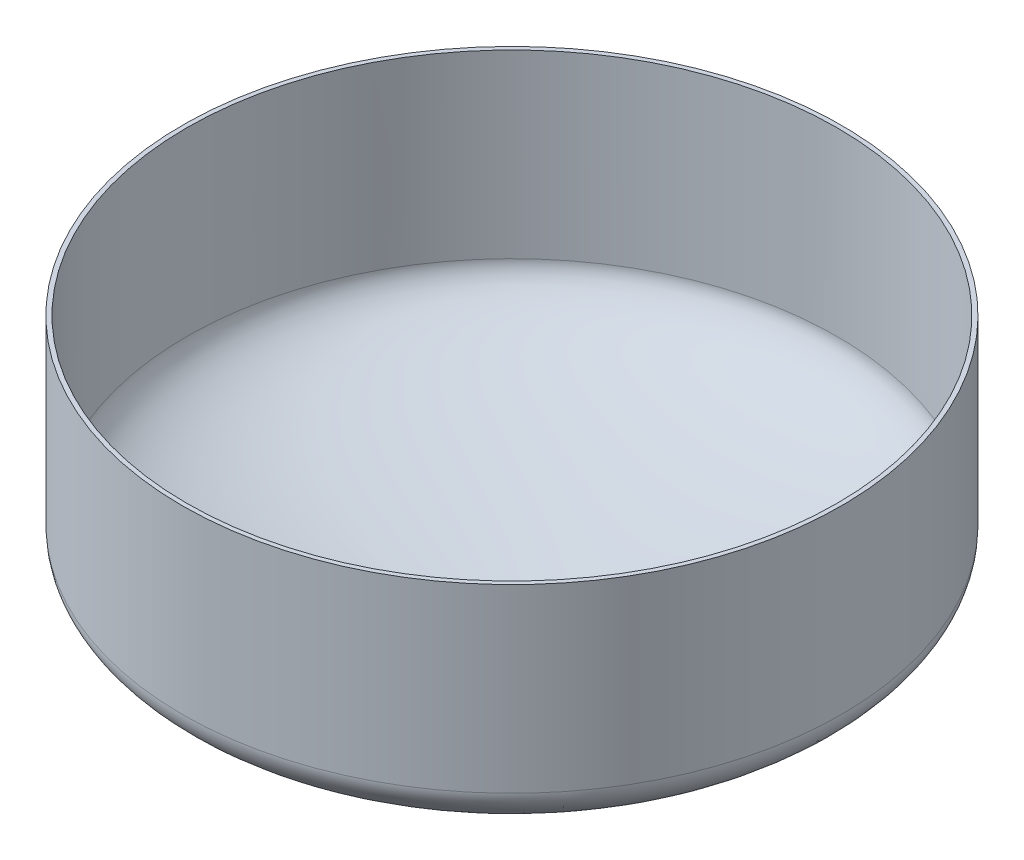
ISO-10303-21;
HEADER;
FILE_DESCRIPTION(('STEP AP214'),'2;1');
FILE_NAME('part.step','',(''),(''),'','','');
FILE_SCHEMA(('AUTOMOTIVE_DESIGN { 1 0 10303 214 1 1 1 1 }'));
ENDSEC;
DATA;
#1=APPLICATION_CONTEXT('core data for automotive mechanical design processes');
#2=APPLICATION_PROTOCOL_DEFINITION('international standard','automotive_design',2000,#1);
#3=PRODUCT_CONTEXT('',#1,'mechanical');
#4=PRODUCT('Part','Part','',(#3));
#5=PRODUCT_RELATED_PRODUCT_CATEGORY('part','',(#4));
#6=PRODUCT_DEFINITION_FORMATION('','',#4);
#7=PRODUCT_DEFINITION_CONTEXT('part definition',#1,'design');
#8=PRODUCT_DEFINITION('design','',#6,#7);
#9=PRODUCT_DEFINITION_SHAPE('','',#8);
#10=(LENGTH_UNIT() NAMED_UNIT(*) SI_UNIT(.MILLI.,.METRE.));
#11=(NAMED_UNIT(*) PLANE_ANGLE_UNIT() SI_UNIT($,.RADIAN.));
#12=(NAMED_UNIT(*) SI_UNIT($,.STERADIAN.) SOLID_ANGLE_UNIT());
#13=UNCERTAINTY_MEASURE_WITH_UNIT(LENGTH_MEASURE(1.E-05),#10,'distance_accuracy_value','');
#14=(GEOMETRIC_REPRESENTATION_CONTEXT(3) GLOBAL_UNCERTAINTY_ASSIGNED_CONTEXT((#13)) GLOBAL_UNIT_ASSIGNED_CONTEXT((#10,
#11,#12)) REPRESENTATION_CONTEXT('',''));
#15=CARTESIAN_POINT('',(0.,0.,0.));
#16=DIRECTION('',(0.,0.,1.));
#17=DIRECTION('',(1.,0.,0.));
#18=AXIS2_PLACEMENT_3D('',#15,#16,#17);
#19=CARTESIAN_POINT('',(0.,165.,-190.));
#20=DIRECTION('',(0.,-1.,0.));
#21=DIRECTION('',(0.,0.,-1.));
#22=AXIS2_PLACEMENT_3D('',#19,#20,#21);
#23=PLANE('',#22);
#24=CARTESIAN_POINT('',(0.,165.,0.));
#25=DIRECTION('',(0.,1.,0.));
#26=DIRECTION('',(0.,0.,1.));
#27=AXIS2_PLACEMENT_3D('',#24,#25,#26);
#28=CIRCLE('',#27,190.);
#29=CARTESIAN_POINT('',(0.,165.,190.));
#30=VERTEX_POINT('',#29);
#31=EDGE_CURVE('E50',#30,#30,#28,.T.);
#32=ORIENTED_EDGE('',*,*,#31,.T.);
#33=EDGE_LOOP('',(#32));
#34=FACE_BOUND('',#33,.T.);
#35=CARTESIAN_POINT('',(0.,165.,0.));
#36=DIRECTION('',(0.,-1.,0.));
#37=DIRECTION('',(0.,0.,-1.));
#38=AXIS2_PLACEMENT_3D('',#35,#36,#37);
#39=CIRCLE('',#38,187.5);
#40=CARTESIAN_POINT('',(0.,165.,-187.5));
#41=VERTEX_POINT('',#40);
#42=EDGE_CURVE('E55',#41,#41,#39,.F.);
#43=ORIENTED_EDGE('',*,*,#42,.F.);
#44=EDGE_LOOP('',(#43));
#45=FACE_BOUND('',#44,.T.);
#46=ADVANCED_FACE('F33',(#34,#45),#23,.F.);
#47=CARTESIAN_POINT('',(0.,0.,0.));
#48=DIRECTION('',(0.,1.,0.));
#49=DIRECTION('',(0.,0.,1.));
#50=AXIS2_PLACEMENT_3D('',#47,#48,#49);
#51=PLANE('',#50);
#52=CARTESIAN_POINT('',(0.,0.,0.));
#53=DIRECTION('',(0.,-1.,0.));
#54=DIRECTION('',(0.,0.,-1.));
#55=AXIS2_PLACEMENT_3D('',#52,#53,#54);
#56=CIRCLE('',#55,9.25);
#57=CARTESIAN_POINT('',(0.,0.,-9.25));
#58=VERTEX_POINT('',#57);
#59=EDGE_CURVE('E56',#58,#58,#56,.T.);
#60=ORIENTED_EDGE('',*,*,#59,.F.);
#61=EDGE_LOOP('',(#60));
#62=FACE_BOUND('',#61,.T.);
#63=CARTESIAN_POINT('',(0.,0.,0.));
#64=DIRECTION('',(0.,1.,0.));
#65=DIRECTION('',(0.,0.,1.));
#66=AXIS2_PLACEMENT_3D('',#63,#64,#65);
#67=CIRCLE('',#66,29.9999999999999);
#68=CARTESIAN_POINT('',(0.,0.,29.9999999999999));
#69=VERTEX_POINT('',#68);
#70=EDGE_CURVE('E10',#69,#69,#67,.T.);
#71=ORIENTED_EDGE('',*,*,#70,.F.);
#72=EDGE_LOOP('',(#71));
#73=FACE_BOUND('',#72,.T.);
#74=ADVANCED_FACE('F35',(#62,#73),#51,.F.);
#75=CARTESIAN_POINT('',(0.,60.7998342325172,187.780368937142));
#76=DIRECTION('',(1.,0.,0.));
#77=DIRECTION('',(0.,0.,-1.));
#78=AXIS2_PLACEMENT_3D('',#75,#76,#77);
#79=ELLIPSE('',#78,377.780368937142,74.407850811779);
#80=TRIMMED_CURVE('',#79,(PARAMETER_VALUE(5.23259887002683)),
(PARAMETER_VALUE(7.33377174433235)),.T.,.PARAMETER.);
#81=CARTESIAN_POINT('',(0.,182.531914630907,0.));
#82=DIRECTION('',(0.,1.,0.));
#83=AXIS1_PLACEMENT('',#81,#82);
#84=SURFACE_OF_REVOLUTION('',#80,#83);
#85=CARTESIAN_POINT('',(112.430937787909,15.6313178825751,0.));
#86=CARTESIAN_POINT('',(112.430940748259,15.6313185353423,-0.421427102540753));
#87=CARTESIAN_POINT('',(112.413594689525,15.627457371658,-0.842804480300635));
#88=CARTESIAN_POINT('',(112.344331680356,15.6120392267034,-1.68270476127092));
#89=CARTESIAN_POINT('',(112.292405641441,15.6004802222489,-2.1012268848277));
#90=CARTESIAN_POINT('',(112.154264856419,15.569727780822,-2.93274574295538));
#91=CARTESIAN_POINT('',(112.068013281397,15.5505261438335,-3.34573604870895));
#92=CARTESIAN_POINT('',(111.861837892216,15.5046230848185,-4.1627987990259));
#93=CARTESIAN_POINT('',(111.741914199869,15.477921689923,-4.56687127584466));
#94=CARTESIAN_POINT('',(111.469314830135,15.4172200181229,-5.36302845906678));
#95=CARTESIAN_POINT('',(111.316655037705,15.3832232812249,-5.75511887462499));
#96=CARTESIAN_POINT('',(110.979633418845,15.3081590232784,-6.52473497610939));
#97=CARTESIAN_POINT('',(110.795271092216,15.2670913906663,-6.90226043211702));
#98=CARTESIAN_POINT('',(110.396209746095,15.1781816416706,-7.63996116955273));
#99=CARTESIAN_POINT('',(110.181518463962,15.1303412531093,-8.0001408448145));
#100=CARTESIAN_POINT('',(109.723292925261,15.0282085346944,-8.70069162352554));
#101=CARTESIAN_POINT('',(109.479758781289,14.9739162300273,-9.0410628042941));
#102=CARTESIAN_POINT('',(108.965551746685,14.8592464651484,-9.69961596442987));
#103=CARTESIAN_POINT('',(108.694875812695,14.7988683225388,-10.0177954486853));
#104=CARTESIAN_POINT('',(108.128335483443,14.6724456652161,-10.6296616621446));
#105=CARTESIAN_POINT('',(107.832471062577,14.6064011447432,-10.923348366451));
#106=CARTESIAN_POINT('',(107.217649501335,14.4690940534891,-11.484151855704));
#107=CARTESIAN_POINT('',(106.898691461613,14.39783127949,-11.7512676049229));
#108=CARTESIAN_POINT('',(106.239965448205,14.2505749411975,-12.2570171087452));
#109=CARTESIAN_POINT('',(105.900197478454,14.1745813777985,-12.4956508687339));
#110=CARTESIAN_POINT('',(105.202275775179,14.0183798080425,-12.9427379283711));
#111=CARTESIAN_POINT('',(104.844122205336,13.9381718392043,-13.1511914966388));
#112=CARTESIAN_POINT('',(104.11197886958,13.7740838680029,-13.5364387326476));
#113=CARTESIAN_POINT('',(103.737989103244,13.6902038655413,-13.7132323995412));
#114=CARTESIAN_POINT('',(102.976839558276,13.5193391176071,-14.03390257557));
#115=CARTESIAN_POINT('',(102.589679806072,13.4323543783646,-14.1777791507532));
#116=CARTESIAN_POINT('',(101.80494892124,13.2558679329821,-14.4315926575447));
#117=CARTESIAN_POINT('',(101.40737778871,13.1663662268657,-14.5415295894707));
#118=CARTESIAN_POINT('',(100.604658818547,12.9854516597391,-14.7266818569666));
#119=CARTESIAN_POINT('',(100.199511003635,12.8940388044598,-14.8018972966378));
#120=CARTESIAN_POINT('',(99.3845247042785,12.7099216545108,-14.9170722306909));
#121=CARTESIAN_POINT('',(98.9746862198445,12.6172173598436,-14.9570317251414));
#122=CARTESIAN_POINT('',(98.1532395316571,12.4311488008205,-15.0014105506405));
#123=CARTESIAN_POINT('',(97.7416313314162,12.3377845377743,-15.005829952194));
#124=CARTESIAN_POINT('',(96.9195763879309,12.1510353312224,-14.9790973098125));
#125=CARTESIAN_POINT('',(96.50912964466,12.0576503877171,-14.9479452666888));
#126=CARTESIAN_POINT('',(95.6923304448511,11.8715066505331,-14.8502924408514));
#127=CARTESIAN_POINT('',(95.2859778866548,11.7787478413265,-14.7837925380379));
#128=CARTESIAN_POINT('',(94.4802486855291,11.5945003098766,-14.6159173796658));
#129=CARTESIAN_POINT('',(94.0808720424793,11.5030115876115,-14.5145421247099));
#130=CARTESIAN_POINT('',(93.2919349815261,11.3219489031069,-14.2776369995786));
#131=CARTESIAN_POINT('',(92.9023745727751,11.2323749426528,-14.1421070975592));
#132=CARTESIAN_POINT('',(92.1358392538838,11.05578156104,-13.837856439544));
#133=CARTESIAN_POINT('',(91.7588643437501,10.9687621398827,-13.6691356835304));
#134=CARTESIAN_POINT('',(91.0201814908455,10.7979096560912,-13.2997051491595));
#135=CARTESIAN_POINT('',(90.6584733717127,10.7140765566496,-13.0989957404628));
#136=CARTESIAN_POINT('',(89.9528857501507,10.5502135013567,-12.667013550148));
#137=CARTESIAN_POINT('',(89.6090062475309,10.4701835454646,-12.4357407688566));
#138=CARTESIAN_POINT('',(88.9415131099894,10.3145272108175,-11.9442760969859));
#139=CARTESIAN_POINT('',(88.6178994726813,10.2389008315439,-11.6840842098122));
#140=CARTESIAN_POINT('',(87.9932290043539,10.092629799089,-11.1366309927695));
#141=CARTESIAN_POINT('',(87.6921721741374,10.0219851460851,-10.8493696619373));
#142=CARTESIAN_POINT('',(87.1147339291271,9.88622584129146,-10.2498089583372));
#143=CARTESIAN_POINT('',(86.8383533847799,9.82111138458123,-9.93750870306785));
#144=CARTESIAN_POINT('',(86.3122317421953,9.69693290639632,-9.29009894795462));
#145=CARTESIAN_POINT('',(86.0624906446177,9.63786888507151,-8.95498944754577));
#146=CARTESIAN_POINT('',(85.5914096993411,9.52626997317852,-8.26434314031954));
#147=CARTESIAN_POINT('',(85.3700698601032,9.47373508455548,-7.90880632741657));
#148=CARTESIAN_POINT('',(84.9573512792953,9.37562822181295,-7.17983271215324));
#149=CARTESIAN_POINT('',(84.7659725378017,9.33005624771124,-6.8063959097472));
#150=CARTESIAN_POINT('',(84.41451958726,9.24625712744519,-6.04426858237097));
#151=CARTESIAN_POINT('',(84.2544460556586,9.20803014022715,-5.65557772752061));
#152=CARTESIAN_POINT('',(83.966734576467,9.13924835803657,-4.86571309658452));
#153=CARTESIAN_POINT('',(83.839096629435,9.10869356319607,-4.46453932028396));
#154=CARTESIAN_POINT('',(83.6171534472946,9.05552032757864,-3.65256120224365));
#155=CARTESIAN_POINT('',(83.5228481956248,9.03290188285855,-3.24175686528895));
#156=CARTESIAN_POINT('',(83.3682327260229,8.99579893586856,-2.41343827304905));
#157=CARTESIAN_POINT('',(83.3079225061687,8.98131443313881,-1.9959240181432));
#158=CARTESIAN_POINT('',(83.2217229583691,8.96060745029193,-1.15717787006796));
#159=CARTESIAN_POINT('',(83.1958316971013,8.95438450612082,-0.735946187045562));
#160=CARTESIAN_POINT('',(83.1786454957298,8.95025413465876,0.107263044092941));
#161=CARTESIAN_POINT('',(83.1873505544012,8.95234670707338,0.529240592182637));
#162=CARTESIAN_POINT('',(83.2392958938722,8.9648288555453,1.37094126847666));
#163=CARTESIAN_POINT('',(83.2825361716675,8.97521843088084,1.79066439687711));
#164=CARTESIAN_POINT('',(83.4032484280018,9.00420290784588,2.62487212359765));
#165=CARTESIAN_POINT('',(83.480720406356,9.02279780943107,3.03935672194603));
#166=CARTESIAN_POINT('',(83.6693487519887,9.06802902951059,3.86012614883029));
#167=CARTESIAN_POINT('',(83.7805039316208,9.09466506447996,4.26641126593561));
#168=CARTESIAN_POINT('',(84.0357187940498,9.15574726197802,5.06790872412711));
#169=CARTESIAN_POINT('',(84.1797784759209,9.19019342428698,5.46312106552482));
#170=CARTESIAN_POINT('',(84.4997897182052,9.26660003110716,6.23966393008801));
#171=CARTESIAN_POINT('',(84.6757412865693,9.30856047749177,6.62099444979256));
#172=CARTESIAN_POINT('',(85.0582983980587,9.39964040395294,7.36706326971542));
#173=CARTESIAN_POINT('',(85.2649039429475,9.44875988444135,7.73180156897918));
#174=CARTESIAN_POINT('',(85.7073268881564,9.55375184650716,8.44211426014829));
#175=CARTESIAN_POINT('',(85.9431459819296,9.60962471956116,8.78768753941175));
#176=CARTESIAN_POINT('',(86.4423239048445,9.72766411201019,9.45719101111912));
#177=CARTESIAN_POINT('',(86.7056827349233,9.78983063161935,9.78112120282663));
#178=CARTESIAN_POINT('',(87.2580812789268,9.9199583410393,10.4050360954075));
#179=CARTESIAN_POINT('',(87.5471210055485,9.98791953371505,10.7050207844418));
#180=CARTESIAN_POINT('',(88.1488385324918,10.1291015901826,11.2789120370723));
#181=CARTESIAN_POINT('',(88.4615163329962,10.2023224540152,11.5528186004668));
#182=CARTESIAN_POINT('',(89.1083087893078,10.3534612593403,12.0726153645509));
#183=CARTESIAN_POINT('',(89.4424241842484,10.4313793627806,12.3185045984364));
#184=CARTESIAN_POINT('',(90.1297151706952,10.5913202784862,12.7805075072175));
#185=CARTESIAN_POINT('',(90.4828907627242,10.6733430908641,12.9966211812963));
#186=CARTESIAN_POINT('',(91.2057969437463,10.8408834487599,13.3975360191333));
#187=CARTESIAN_POINT('',(91.5755275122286,10.926400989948,13.5823372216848));
#188=CARTESIAN_POINT('',(92.3289192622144,11.1003058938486,13.9193133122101));
#189=CARTESIAN_POINT('',(92.7125804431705,11.1886932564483,14.0714882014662));
#190=CARTESIAN_POINT('',(93.491092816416,11.3676986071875,14.3421244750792));
#191=CARTESIAN_POINT('',(93.8859435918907,11.4583165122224,14.4605871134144));
#192=CARTESIAN_POINT('',(94.6840412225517,11.6411434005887,14.6629640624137));
#193=CARTESIAN_POINT('',(95.0872880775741,11.733352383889,14.7468783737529));
#194=CARTESIAN_POINT('',(95.8993094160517,11.9187156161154,14.8795620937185));
#195=CARTESIAN_POINT('',(96.3080839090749,12.0118698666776,14.9283314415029));
#196=CARTESIAN_POINT('',(97.1282498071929,12.1984776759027,14.9903782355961));
#197=CARTESIAN_POINT('',(97.5396412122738,12.2919312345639,15.0036556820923));
#198=CARTESIAN_POINT('',(98.3621012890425,12.4784930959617,14.9946244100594));
#199=CARTESIAN_POINT('',(98.7731699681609,12.5716014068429,14.9723165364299));
#200=CARTESIAN_POINT('',(99.5920660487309,12.7568393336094,14.892274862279));
#201=CARTESIAN_POINT('',(99.9998934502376,12.8489689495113,14.8345410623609));
#202=CARTESIAN_POINT('',(100.809401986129,13.0316237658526,14.6840578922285));
#203=CARTESIAN_POINT('',(101.211083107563,13.1221489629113,14.5913084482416));
#204=CARTESIAN_POINT('',(102.005435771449,13.3009817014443,14.3714534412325));
#205=CARTESIAN_POINT('',(102.398107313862,13.3892892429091,14.2443478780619));
#206=CARTESIAN_POINT('',(103.171657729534,13.5630930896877,13.956678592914));
#207=CARTESIAN_POINT('',(103.552536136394,13.6485892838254,13.7961135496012));
#208=CARTESIAN_POINT('',(104.299769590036,13.8161889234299,13.4426698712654));
#209=CARTESIAN_POINT('',(104.666124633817,13.8982923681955,13.249791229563));
#210=CARTESIAN_POINT('',(105.38168648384,14.0585479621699,12.8330997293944));
#211=CARTESIAN_POINT('',(105.730893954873,14.1367002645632,12.6092880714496));
#212=CARTESIAN_POINT('',(106.409687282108,14.2885273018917,12.1323160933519));
#213=CARTESIAN_POINT('',(106.739273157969,14.362202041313,11.879155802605));
#214=CARTESIAN_POINT('',(107.37644816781,14.5045673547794,11.3453088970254));
#215=CARTESIAN_POINT('',(107.684039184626,14.5732583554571,11.0646246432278));
#216=CARTESIAN_POINT('',(108.275065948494,14.7051952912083,10.477705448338));
#217=CARTESIAN_POINT('',(108.558501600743,14.768441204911,10.1714704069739));
#218=CARTESIAN_POINT('',(109.099266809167,14.8890705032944,9.53554597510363));
#219=CARTESIAN_POINT('',(109.356589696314,14.9464523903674,9.20585062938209));
#220=CARTESIAN_POINT('',(109.843210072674,15.0549402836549,8.52542487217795));
#221=CARTESIAN_POINT('',(110.072508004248,15.1060463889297,8.17469479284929));
#222=CARTESIAN_POINT('',(110.501553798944,15.2016545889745,7.45451420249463));
#223=CARTESIAN_POINT('',(110.701287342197,15.2461534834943,7.08505473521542));
#224=CARTESIAN_POINT('',(111.069648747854,15.3282097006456,6.33020218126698));
#225=CARTESIAN_POINT('',(111.238276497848,15.3657669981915,5.9448090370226));
#226=CARTESIAN_POINT('',(111.543060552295,15.4336425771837,5.16124632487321));
#227=CARTESIAN_POINT('',(111.679251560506,15.4639685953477,4.76309093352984));
#228=CARTESIAN_POINT('',(111.918392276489,15.5172150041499,3.95657821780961));
#229=CARTESIAN_POINT('',(112.021350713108,15.5401373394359,3.54822360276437));
#230=CARTESIAN_POINT('',(112.214801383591,15.5832047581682,2.62122260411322));
#231=CARTESIAN_POINT('',(112.295783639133,15.6012321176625,2.10046465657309));
#232=CARTESIAN_POINT('',(112.40384999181,15.6252882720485,1.05311193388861));
#233=CARTESIAN_POINT('',(112.430934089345,15.6313170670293,0.526517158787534));
#234=CARTESIAN_POINT('',(112.430937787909,15.6313178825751,0.));
#235=B_SPLINE_CURVE_WITH_KNOTS('',3,(#85,#86,#87,#88,#89,#90,#91,#92,#93,#94,#95,#96,#97,#98,
#99,#100,#101,#102,#103,#104,#105,#106,#107,#108,#109,#110,#111,#112,#113,#114,#115,#116,#117,
#118,#119,#120,#121,#122,#123,#124,#125,#126,#127,#128,#129,#130,#131,#132,#133,#134,#135,#136,
#137,#138,#139,#140,#141,#142,#143,#144,#145,#146,#147,#148,#149,#150,#151,#152,#153,#154,#155,
#156,#157,#158,#159,#160,#161,#162,#163,#164,#165,#166,#167,#168,#169,#170,#171,#172,#173,#174,
#175,#176,#177,#178,#179,#180,#181,#182,#183,#184,#185,#186,#187,#188,#189,#190,#191,#192,#193,
#194,#195,#196,#197,#198,#199,#200,#201,#202,#203,#204,#205,#206,#207,#208,#209,#210,#211,#212,
#213,#214,#215,#216,#217,#218,#219,#220,#221,#222,#223,#224,#225,#226,#227,#228,#229,#230,#231,
#232,#233,#234),.UNSPECIFIED.,.T.,.F.,(4,2,2,2,2,2,2,2,2,2,2,2,2,2,2,2,2,2,2,2,2,2,2,2,2,2,2,2,
2,2,2,2,2,2,2,2,2,2,2,2,2,2,2,2,2,2,2,2,2,2,2,2,2,2,2,2,2,2,2,2,2,2,2,2,2,2,2,2,2,2,2,2,2,2,4),
(0.,1.26382140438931,2.52797510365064,3.79348882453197,5.05899796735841,6.32389441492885,
7.58881082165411,8.85340511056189,10.1179944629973,11.3827257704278,12.6474583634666,
13.912240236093,15.1770218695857,16.441792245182,17.7065626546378,18.9713305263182,
20.2360983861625,21.5008624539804,22.7656265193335,24.0303880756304,25.2951496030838,
26.5598796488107,27.8246096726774,29.0893408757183,30.3540720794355,31.6187886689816,
32.8835052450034,34.1482216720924,35.4129381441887,36.677699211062,37.9424603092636,
39.207221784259,40.4719832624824,41.7367721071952,43.0015609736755,44.2663492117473,
45.531137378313,46.7958544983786,48.0605715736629,49.3252885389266,50.5900054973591,
51.8546778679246,53.1193502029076,54.3840228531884,55.6486955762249,56.9134416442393,
58.1781877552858,59.4429344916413,60.7076812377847,61.9724716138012,63.2372620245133,
64.5020508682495,65.7668396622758,67.0315814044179,68.2963231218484,69.561067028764,
70.8258109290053,72.0905248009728,73.3552386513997,74.6199551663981,75.884671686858,
77.1494381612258,78.4142048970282,79.6789225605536,80.9436389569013,82.2082469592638,
83.4728599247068,84.7377950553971,86.0027102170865,87.2682360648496,88.5337664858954,
89.7979367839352,91.0617747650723,92.64075166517,94.2197285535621),.UNSPECIFIED.);
#236=CARTESIAN_POINT('',(112.430937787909,15.6313178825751,0.));
#237=VERTEX_POINT('',#236);
#238=EDGE_CURVE('E63',#237,#237,#235,.T.);
#239=ORIENTED_EDGE('',*,*,#238,.T.);
#240=EDGE_LOOP('',(#239));
#241=FACE_BOUND('',#240,.T.);
#242=CARTESIAN_POINT('',(0.,60.7998342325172,0.));
#243=DIRECTION('',(0.,1.,0.));
#244=DIRECTION('',(0.,0.,1.));
#245=AXIS2_PLACEMENT_3D('',#242,#243,#244);
#246=CIRCLE('',#245,190.);
#247=CARTESIAN_POINT('',(0.,60.7998342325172,190.));
#248=VERTEX_POINT('',#247);
#249=EDGE_CURVE('E45',#248,#248,#246,.T.);
#250=ORIENTED_EDGE('',*,*,#249,.F.);
#251=EDGE_LOOP('',(#250));
#252=FACE_BOUND('',#251,.T.);
#253=ORIENTED_EDGE('',*,*,#70,.T.);
#254=EDGE_LOOP('',(#253));
#255=FACE_BOUND('',#254,.T.);
#256=ADVANCED_FACE('F97',(#241,#252,#255),#84,.T.);
#257=CARTESIAN_POINT('',(0.,182.531914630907,0.));
#258=DIRECTION('',(0.,1.,0.));
#259=DIRECTION('',(0.,0.,1.));
#260=AXIS2_PLACEMENT_3D('',#257,#258,#259);
#261=CYLINDRICAL_SURFACE('',#260,190.);
#262=ORIENTED_EDGE('',*,*,#31,.F.);
#263=EDGE_LOOP('',(#262));
#264=FACE_BOUND('',#263,.T.);
#265=ORIENTED_EDGE('',*,*,#249,.T.);
#266=EDGE_LOOP('',(#265));
#267=FACE_BOUND('',#266,.T.);
#268=ADVANCED_FACE('F94',(#264,#267),#261,.T.);
#269=CARTESIAN_POINT('',(0.,2.49999999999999,0.));
#270=DIRECTION('',(0.,1.,0.));
#271=DIRECTION('',(0.,0.,1.));
#272=AXIS2_PLACEMENT_3D('',#269,#270,#271);
#273=PLANE('',#272);
#274=CARTESIAN_POINT('',(0.,2.49999999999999,0.));
#275=DIRECTION('',(0.,1.,0.));
#276=DIRECTION('',(0.,0.,1.));
#277=AXIS2_PLACEMENT_3D('',#274,#275,#276);
#278=CIRCLE('',#277,9.25);
#279=CARTESIAN_POINT('',(0.,2.49999999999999,9.25));
#280=VERTEX_POINT('',#279);
#281=EDGE_CURVE('E53',#280,#280,#278,.T.);
#282=ORIENTED_EDGE('',*,*,#281,.F.);
#283=EDGE_LOOP('',(#282));
#284=FACE_BOUND('',#283,.T.);
#285=CARTESIAN_POINT('',(0.,2.5,0.));
#286=DIRECTION('',(0.,1.,0.));
#287=DIRECTION('',(0.,0.,1.));
#288=AXIS2_PLACEMENT_3D('',#285,#286,#287);
#289=CIRCLE('',#288,29.8270353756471);
#290=CARTESIAN_POINT('',(0.,2.5,29.8270353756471));
#291=VERTEX_POINT('',#290);
#292=EDGE_CURVE('E72',#291,#291,#289,.T.);
#293=ORIENTED_EDGE('',*,*,#292,.T.);
#294=EDGE_LOOP('',(#293));
#295=FACE_BOUND('',#294,.T.);
#296=ADVANCED_FACE('F96',(#284,#295),#273,.T.);
#297=CARTESIAN_POINT('',(0.,60.7998342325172,187.780368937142));
#298=DIRECTION('',(1.,0.,0.));
#299=DIRECTION('',(0.,0.,-1.));
#300=AXIS2_PLACEMENT_3D('',#297,#298,#299);
#301=ELLIPSE('',#300,377.780368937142,74.407850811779);
#302=TRIMMED_CURVE('',#301,(PARAMETER_VALUE(5.23259887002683)),
(PARAMETER_VALUE(7.33377174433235)),.T.,.PARAMETER.);
#303=CARTESIAN_POINT('',(0.,182.531914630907,0.));
#304=DIRECTION('',(0.,1.,0.));
#305=AXIS1_PLACEMENT('',#303,#304);
#306=SURFACE_OF_REVOLUTION('',#302,#305);
#307=OFFSET_SURFACE('',#306,-2.5,.F.);
#308=CARTESIAN_POINT('',(111.876049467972,18.0700158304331,0.));
#309=CARTESIAN_POINT('',(111.87605242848,18.0700164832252,-0.421427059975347));
#310=CARTESIAN_POINT('',(111.858706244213,18.0661558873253,-0.842804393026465));
#311=CARTESIAN_POINT('',(111.78944273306,18.0507400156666,-1.6827045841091));
#312=CARTESIAN_POINT('',(111.737516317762,18.0391827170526,-2.10122666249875));
#313=CARTESIAN_POINT('',(111.599374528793,18.0084348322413,-2.932745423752));
#314=CARTESIAN_POINT('',(111.51312232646,17.9892360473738,-3.34573567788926));
#315=CARTESIAN_POINT('',(111.306945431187,17.9433398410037,-4.16279832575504));
#316=CARTESIAN_POINT('',(111.187020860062,17.9166424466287,-4.56687075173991));
#317=CARTESIAN_POINT('',(110.914419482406,17.8559499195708,-5.36302783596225));
#318=CARTESIAN_POINT('',(110.761758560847,17.8219583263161,-5.75511820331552));
#319=CARTESIAN_POINT('',(110.424734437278,17.7469054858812,-6.52473421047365));
#320=CARTESIAN_POINT('',(110.240370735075,17.7058441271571,-6.90225962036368));
#321=CARTESIAN_POINT('',(109.841306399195,17.6169480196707,-7.63996027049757));
#322=CARTESIAN_POINT('',(109.626613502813,17.5691149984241,-8.00013990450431));
#323=CARTESIAN_POINT('',(109.168384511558,17.4669980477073,-8.7006906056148));
#324=CARTESIAN_POINT('',(108.924848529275,17.4127141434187,-9.04106175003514));
#325=CARTESIAN_POINT('',(108.410637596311,17.2980621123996,-9.69961486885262));
#326=CARTESIAN_POINT('',(108.139959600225,17.2376933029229,-10.0177943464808));
#327=CARTESIAN_POINT('',(107.573414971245,17.1112901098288,-10.6296605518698));
#328=CARTESIAN_POINT('',(107.277548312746,17.0452557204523,-10.9233472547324));
#329=CARTESIAN_POINT('',(106.662722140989,16.9079695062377,-11.4841507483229));
#330=CARTESIAN_POINT('',(106.343761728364,16.836717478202,-11.7512665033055));
#331=CARTESIAN_POINT('',(105.685030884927,16.6894830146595,-12.2570160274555));
#332=CARTESIAN_POINT('',(105.345260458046,16.6135005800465,-12.4956498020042));
#333=CARTESIAN_POINT('',(104.647333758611,16.4573213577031,-12.9427369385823));
#334=CARTESIAN_POINT('',(104.289177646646,16.3771246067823,-13.1511905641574));
#335=CARTESIAN_POINT('',(103.557029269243,16.2130588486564,-13.5364379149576));
#336=CARTESIAN_POINT('',(103.183037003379,16.1291898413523,-13.7132316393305));
#337=CARTESIAN_POINT('',(102.421882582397,15.9583464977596,-14.033901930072));
#338=CARTESIAN_POINT('',(102.034720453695,15.8713721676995,-14.1777785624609));
#339=CARTESIAN_POINT('',(101.249985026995,15.6949055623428,-14.4315921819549));
#340=CARTESIAN_POINT('',(100.852411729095,15.60541328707,-14.5415291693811));
#341=CARTESIAN_POINT('',(100.0496887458,15.4245161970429,-14.7266815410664));
#342=CARTESIAN_POINT('',(99.6445390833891,15.3331113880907,-14.8018970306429));
#343=CARTESIAN_POINT('',(98.8295494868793,15.1490085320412,-14.9170720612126));
#344=CARTESIAN_POINT('',(98.4197095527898,15.0563104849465,-14.9570316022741));
#345=CARTESIAN_POINT('',(97.5982604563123,14.8702522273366,-15.001410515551));
#346=CARTESIAN_POINT('',(97.1866512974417,14.7768920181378,-15.0058299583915));
#347=CARTESIAN_POINT('',(96.3645950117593,14.5901483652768,-14.97909739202));
#348=CARTESIAN_POINT('',(95.9541478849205,14.4967649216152,-14.9479453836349));
#349=CARTESIAN_POINT('',(95.137348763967,14.3106213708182,-14.8502926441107));
#350=CARTESIAN_POINT('',(94.7309966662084,14.2178612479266,-14.7837928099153));
#351=CARTESIAN_POINT('',(93.9252690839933,14.0336080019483,-14.6159178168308));
#352=CARTESIAN_POINT('',(93.5258935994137,13.9421148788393,-14.5145426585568));
#353=CARTESIAN_POINT('',(92.7369595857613,13.7610401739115,-14.2776377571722));
#354=CARTESIAN_POINT('',(92.3474010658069,13.6714585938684,-14.1421079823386));
#355=CARTESIAN_POINT('',(91.5808702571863,13.4948467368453,-13.837857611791));
#356=CARTESIAN_POINT('',(91.2038979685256,13.4078164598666,-13.6691370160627));
#357=CARTESIAN_POINT('',(90.4652211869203,13.2369391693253,-13.2997069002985));
#358=CARTESIAN_POINT('',(90.1035165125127,13.1530921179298,-13.0989977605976));
#359=CARTESIAN_POINT('',(89.3979364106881,12.9891982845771,-12.6670161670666));
#360=CARTESIAN_POINT('',(89.0540609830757,12.9091515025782,-12.4357437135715));
#361=CARTESIAN_POINT('',(88.3865765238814,12.7534590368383,-11.9442797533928));
#362=CARTESIAN_POINT('',(88.0629674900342,12.6778133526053,-11.6840882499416));
#363=CARTESIAN_POINT('',(87.4383066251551,12.531501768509,-11.1366358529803));
#364=CARTESIAN_POINT('',(87.137254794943,12.4608358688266,-10.8493749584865));
#365=CARTESIAN_POINT('',(86.5598265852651,12.3250327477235,-10.2498149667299));
#366=CARTESIAN_POINT('',(86.2834510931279,12.2598957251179,-9.93751496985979));
#367=CARTESIAN_POINT('',(85.7573396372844,12.1356716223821,-9.2901057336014));
#368=CARTESIAN_POINT('',(85.507603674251,12.0765845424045,-8.95499649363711));
#369=CARTESIAN_POINT('',(85.036532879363,11.964939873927,-8.26435069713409));
#370=CARTESIAN_POINT('',(84.8151980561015,11.9123822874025,-7.90881413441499));
#371=CARTESIAN_POINT('',(84.4024891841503,11.8142312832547,-7.17984099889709));
#372=CARTESIAN_POINT('',(84.2111151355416,11.7686378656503,-6.80640442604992));
#373=CARTESIAN_POINT('',(83.8596709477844,11.6847979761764,-6.04427731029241));
#374=CARTESIAN_POINT('',(83.6996015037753,11.6465516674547,-5.65558642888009));
#375=CARTESIAN_POINT('',(83.4118975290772,11.5777342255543,-4.86572169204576));
#376=CARTESIAN_POINT('',(83.28426299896,11.5471630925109,-4.46454783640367));
#377=CARTESIAN_POINT('',(83.0623258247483,11.4939608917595,-3.65256951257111));
#378=CARTESIAN_POINT('',(82.9680231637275,11.4713298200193,-3.24176504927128));
#379=CARTESIAN_POINT('',(82.813411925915,11.4342059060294,-2.41344615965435));
#380=CARTESIAN_POINT('',(82.7531033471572,11.419713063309,-1.99593173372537));
#381=CARTESIAN_POINT('',(82.6669061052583,11.3989940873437,-1.15718573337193));
#382=CARTESIAN_POINT('',(82.6410154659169,11.3927674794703,-0.735954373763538));
#383=CARTESIAN_POINT('',(82.6238293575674,11.3886346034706,0.107254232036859));
#384=CARTESIAN_POINT('',(82.6325338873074,11.3907283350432,0.529231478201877));
#385=CARTESIAN_POINT('',(82.6844770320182,11.403217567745,1.37093156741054));
#386=CARTESIAN_POINT('',(82.7277156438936,11.4136130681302,1.79065441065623));
#387=CARTESIAN_POINT('',(82.8484234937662,11.4426138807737,2.62486158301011));
#388=CARTESIAN_POINT('',(82.925892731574,11.4612191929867,3.03934591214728));
#389=CARTESIAN_POINT('',(83.1145145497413,11.506475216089,3.86011447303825));
#390=CARTESIAN_POINT('',(83.2256659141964,11.5331256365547,4.26639900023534));
#391=CARTESIAN_POINT('',(83.4808722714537,11.594239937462,5.06789532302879));
#392=CARTESIAN_POINT('',(83.6249272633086,11.6287038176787,5.46310711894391));
#393=CARTESIAN_POINT('',(83.9449284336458,11.7051484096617,6.23964895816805));
#394=CARTESIAN_POINT('',(84.120874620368,11.7471291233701,6.62097899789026));
#395=CARTESIAN_POINT('',(84.5034204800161,11.8382512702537,7.36704694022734));
#396=CARTESIAN_POINT('',(84.7100201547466,11.8873927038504,7.73178484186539));
#397=CARTESIAN_POINT('',(85.1524313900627,11.9924294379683,8.44209732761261));
#398=CARTESIAN_POINT('',(85.3882446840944,12.0483251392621,8.78767077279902));
#399=CARTESIAN_POINT('',(85.8874110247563,12.1664101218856,9.45717463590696));
#400=CARTESIAN_POINT('',(86.1507640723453,12.2285994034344,9.78110505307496));
#401=CARTESIAN_POINT('',(86.7031512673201,12.3587717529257,10.4050204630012));
#402=CARTESIAN_POINT('',(86.9921854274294,12.4267548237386,10.7050054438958));
#403=CARTESIAN_POINT('',(87.5938922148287,12.5679790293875,11.2788973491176));
#404=CARTESIAN_POINT('',(87.9065648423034,12.6412201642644,11.5528042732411));
#405=CARTESIAN_POINT('',(88.5533477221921,12.792397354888,12.0726020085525));
#406=CARTESIAN_POINT('',(88.8874587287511,12.8703335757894,12.318491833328));
#407=CARTESIAN_POINT('',(89.5747416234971,13.0303080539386,12.7804959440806));
#408=CARTESIAN_POINT('',(89.9279135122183,13.1123463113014,12.9966102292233));
#409=CARTESIAN_POINT('',(90.6508130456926,13.2799145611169,13.3975262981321));
#410=CARTESIAN_POINT('',(91.02054066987,13.3654445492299,13.5823281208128));
#411=CARTESIAN_POINT('',(91.7739273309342,13.5393711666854,13.9193054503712));
#412=CARTESIAN_POINT('',(92.1575863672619,13.6277677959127,14.0714809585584));
#413=CARTESIAN_POINT('',(92.9360949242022,13.8067883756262,14.3421183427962));
#414=CARTESIAN_POINT('',(93.3309440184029,13.8974122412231,14.4605815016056));
#415=CARTESIAN_POINT('',(94.1290390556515,14.0802478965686,14.6629595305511));
#416=CARTESIAN_POINT('',(94.5322849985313,14.1724596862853,14.7468744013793));
#417=CARTESIAN_POINT('',(95.3443052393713,14.3578255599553,14.8795592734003));
#418=CARTESIAN_POINT('',(95.7530795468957,14.4509796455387,14.9283292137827));
#419=CARTESIAN_POINT('',(96.5732457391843,14.6375844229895,14.9903772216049));
#420=CARTESIAN_POINT('',(96.9846376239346,14.7310351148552,15.0036552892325));
#421=CARTESIAN_POINT('',(97.8070991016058,14.9175888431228,14.9946252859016));
#422=CARTESIAN_POINT('',(98.2181687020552,15.010691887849,14.972318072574));
#423=CARTESIAN_POINT('',(99.0370671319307,15.1959172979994,14.8922777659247));
#424=CARTESIAN_POINT('',(99.4448959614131,15.2880396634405,14.8345446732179));
#425=CARTESIAN_POINT('',(100.254407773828,15.470678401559,14.6840629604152));
#426=CARTESIAN_POINT('',(100.656090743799,15.5611947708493,14.5913142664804));
#427=CARTESIAN_POINT('',(101.450447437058,15.7400086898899,14.3714607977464));
#428=CARTESIAN_POINT('',(101.843121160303,15.8283062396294,14.2443560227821));
#429=CARTESIAN_POINT('',(102.616676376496,16.0020893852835,13.956688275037));
#430=CARTESIAN_POINT('',(102.997557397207,16.0875748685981,13.7961239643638));
#431=CARTESIAN_POINT('',(103.744796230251,16.2551527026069,13.4426817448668));
#432=CARTESIAN_POINT('',(104.111154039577,16.3372450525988,13.2498038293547));
#433=CARTESIAN_POINT('',(104.82672149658,16.4974784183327,12.8331137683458));
#434=CARTESIAN_POINT('',(105.175931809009,16.5756195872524,12.6093028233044));
#435=CARTESIAN_POINT('',(105.854730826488,16.727424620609,12.1323322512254));
#436=CARTESIAN_POINT('',(106.184319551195,16.8010884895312,11.8791726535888));
#437=CARTESIAN_POINT('',(106.82150032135,16.943432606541,11.3453270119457));
#438=CARTESIAN_POINT('',(107.129094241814,17.0121132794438,11.0646433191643));
#439=CARTESIAN_POINT('',(107.720126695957,17.1440302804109,10.4777251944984));
#440=CARTESIAN_POINT('',(108.003565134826,17.2072665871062,10.1714906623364));
#441=CARTESIAN_POINT('',(108.544335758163,17.3278775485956,9.53556719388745));
#442=CARTESIAN_POINT('',(108.801661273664,17.3852507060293,9.20587230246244));
#443=CARTESIAN_POINT('',(109.288286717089,17.4937221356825,8.52544739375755));
#444=CARTESIAN_POINT('',(109.517587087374,17.544820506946,8.1747177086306));
#445=CARTESIAN_POINT('',(109.946637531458,17.6404143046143,7.45453787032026));
#446=CARTESIAN_POINT('',(110.146373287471,17.6849065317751,7.08507876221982));
#447=CARTESIAN_POINT('',(110.514738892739,17.7669505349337,6.33022686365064));
#448=CARTESIAN_POINT('',(110.683368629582,17.8045022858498,5.94483401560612));
#449=CARTESIAN_POINT('',(110.98815642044,17.8723679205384,5.16127182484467));
#450=CARTESIAN_POINT('',(111.124349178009,17.9026895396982,4.76311665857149));
#451=CARTESIAN_POINT('',(111.363493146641,17.9559282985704,3.95660432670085));
#452=CARTESIAN_POINT('',(111.466453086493,17.9788473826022,3.54824987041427));
#453=CARTESIAN_POINT('',(111.659907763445,18.0219089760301,2.62124480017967));
#454=CARTESIAN_POINT('',(111.740892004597,18.0399339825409,2.10048250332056));
#455=CARTESIAN_POINT('',(111.848961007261,18.0639870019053,1.05312093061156));
#456=CARTESIAN_POINT('',(111.87604576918,18.0700150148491,0.526521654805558));
#457=CARTESIAN_POINT('',(111.876049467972,18.0700158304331,0.));
#458=B_SPLINE_CURVE_WITH_KNOTS('',3,(#308,#309,#310,#311,#312,#313,#314,#315,#316,#317,#318,
#319,#320,#321,#322,#323,#324,#325,#326,#327,#328,#329,#330,#331,#332,#333,#334,#335,#336,#337,
#338,#339,#340,#341,#342,#343,#344,#345,#346,#347,#348,#349,#350,#351,#352,#353,#354,#355,#356,
#357,#358,#359,#360,#361,#362,#363,#364,#365,#366,#367,#368,#369,#370,#371,#372,#373,#374,#375,
#376,#377,#378,#379,#380,#381,#382,#383,#384,#385,#386,#387,#388,#389,#390,#391,#392,#393,#394,
#395,#396,#397,#398,#399,#400,#401,#402,#403,#404,#405,#406,#407,#408,#409,#410,#411,#412,#413,
#414,#415,#416,#417,#418,#419,#420,#421,#422,#423,#424,#425,#426,#427,#428,#429,#430,#431,#432,
#433,#434,#435,#436,#437,#438,#439,#440,#441,#442,#443,#444,#445,#446,#447,#448,#449,#450,#451,
#452,#453,#454,#455,#456,#457),.UNSPECIFIED.,.T.,.F.,(4,2,2,2,2,2,2,2,2,2,2,2,2,2,2,2,2,2,2,2,2,
2,2,2,2,2,2,2,2,2,2,2,2,2,2,2,2,2,2,2,2,2,2,2,2,2,2,2,2,2,2,2,2,2,2,2,2,2,2,2,2,2,2,2,2,2,2,2,2,
2,2,2,2,2,4),(0.,1.26382127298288,2.52797483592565,3.79348840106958,5.05899738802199,
6.32389368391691,7.58880993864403,8.85340408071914,10.1179932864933,11.3827245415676,
12.6474570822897,13.91223890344,15.1770204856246,16.4417910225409,17.7065615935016,
18.9713296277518,20.2360976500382,21.5008618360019,22.7656260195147,24.0303876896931,
25.295149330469,26.5598788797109,27.8246084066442,29.0893391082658,30.3540698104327,
31.6187854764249,32.8835011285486,34.148216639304,35.412932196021,36.6776932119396,
37.9424542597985,39.2072156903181,40.4719771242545,41.7367666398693,43.001556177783,
44.2663450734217,45.5311338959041,46.7958500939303,48.0605662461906,49.325282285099,
50.5899983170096,51.8546686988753,53.1193390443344,54.3840097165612,55.6486804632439,
56.9134262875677,58.1781721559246,59.4429186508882,60.7076651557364,61.9724561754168,
63.2372472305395,64.502036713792,65.766826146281,67.0315674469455,68.2963087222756,
69.5610521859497,70.8257956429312,72.0905086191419,73.3552215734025,74.6199371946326,
75.884652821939,77.149419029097,78.4141854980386,79.678902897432,80.9436190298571,
82.2082272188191,83.4728403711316,84.7377756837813,86.0026910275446,87.2682169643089,
88.5337474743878,89.7979178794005,91.0617559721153,92.6407463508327,94.2197367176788),.UNSPECIFIED.);
#459=CARTESIAN_POINT('',(111.876049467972,18.0700158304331,0.));
#460=VERTEX_POINT('',#459);
#461=EDGE_CURVE('E37',#460,#460,#458,.T.);
#462=ORIENTED_EDGE('',*,*,#461,.F.);
#463=EDGE_LOOP('',(#462));
#464=FACE_BOUND('',#463,.T.);
#465=CARTESIAN_POINT('',(0.,60.7998342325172,0.));
#466=DIRECTION('',(0.,1.,0.));
#467=DIRECTION('',(0.,0.,1.));
#468=AXIS2_PLACEMENT_3D('',#465,#466,#467);
#469=CIRCLE('',#468,187.5);
#470=CARTESIAN_POINT('',(0.,60.7998342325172,187.5));
#471=VERTEX_POINT('',#470);
#472=EDGE_CURVE('E60',#471,#471,#469,.T.);
#473=ORIENTED_EDGE('',*,*,#472,.T.);
#474=EDGE_LOOP('',(#473));
#475=FACE_BOUND('',#474,.T.);
#476=ORIENTED_EDGE('',*,*,#292,.F.);
#477=EDGE_LOOP('',(#476));
#478=FACE_BOUND('',#477,.T.);
#479=ADVANCED_FACE('F83',(#464,#475,#478),#307,.F.);
#480=CARTESIAN_POINT('',(0.,182.531914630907,0.));
#481=DIRECTION('',(0.,1.,0.));
#482=DIRECTION('',(0.,0.,1.));
#483=AXIS2_PLACEMENT_3D('',#480,#481,#482);
#484=CYLINDRICAL_SURFACE('',#483,187.5);
#485=ORIENTED_EDGE('',*,*,#42,.T.);
#486=EDGE_LOOP('',(#485));
#487=FACE_BOUND('',#486,.T.);
#488=ORIENTED_EDGE('',*,*,#472,.F.);
#489=EDGE_LOOP('',(#488));
#490=FACE_BOUND('',#489,.T.);
#491=ADVANCED_FACE('F86',(#487,#490),#484,.F.);
#492=CARTESIAN_POINT('',(0.,165.,0.));
#493=DIRECTION('',(0.,-1.,0.));
#494=DIRECTION('',(0.,0.,-1.));
#495=AXIS2_PLACEMENT_3D('',#492,#493,#494);
#496=CYLINDRICAL_SURFACE('',#495,9.25);
#497=ORIENTED_EDGE('',*,*,#281,.T.);
#498=EDGE_LOOP('',(#497));
#499=FACE_BOUND('',#498,.T.);
#500=ORIENTED_EDGE('',*,*,#59,.T.);
#501=EDGE_LOOP('',(#500));
#502=FACE_BOUND('',#501,.T.);
#503=ADVANCED_FACE('F89',(#499,#502),#496,.F.);
#504=CARTESIAN_POINT('',(50.6044166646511,219.745845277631,0.));
#505=DIRECTION('',(0.221863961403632,-0.975077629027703,0.));
#506=DIRECTION('',(0.975077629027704,0.221863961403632,0.));
#507=AXIS2_PLACEMENT_3D('',#504,#505,#506);
#508=CYLINDRICAL_SURFACE('',#507,15.);
#509=ORIENTED_EDGE('',*,*,#461,.T.);
#510=EDGE_LOOP('',(#509));
#511=FACE_BOUND('',#510,.T.);
#512=ORIENTED_EDGE('',*,*,#238,.F.);
#513=EDGE_LOOP('',(#512));
#514=FACE_BOUND('',#513,.T.);
#515=ADVANCED_FACE('F111',(#511,#514),#508,.F.);
#516=CLOSED_SHELL('',(#46,#74,#256,#268,#296,#479,#491,#503,#515));
#517=MANIFOLD_SOLID_BREP('B2',#516);
#518=ADVANCED_BREP_SHAPE_REPRESENTATION('',(#18,#517),#14);
#519=SHAPE_DEFINITION_REPRESENTATION(#9,#518);
ENDSEC;
END-ISO-10303-21;
